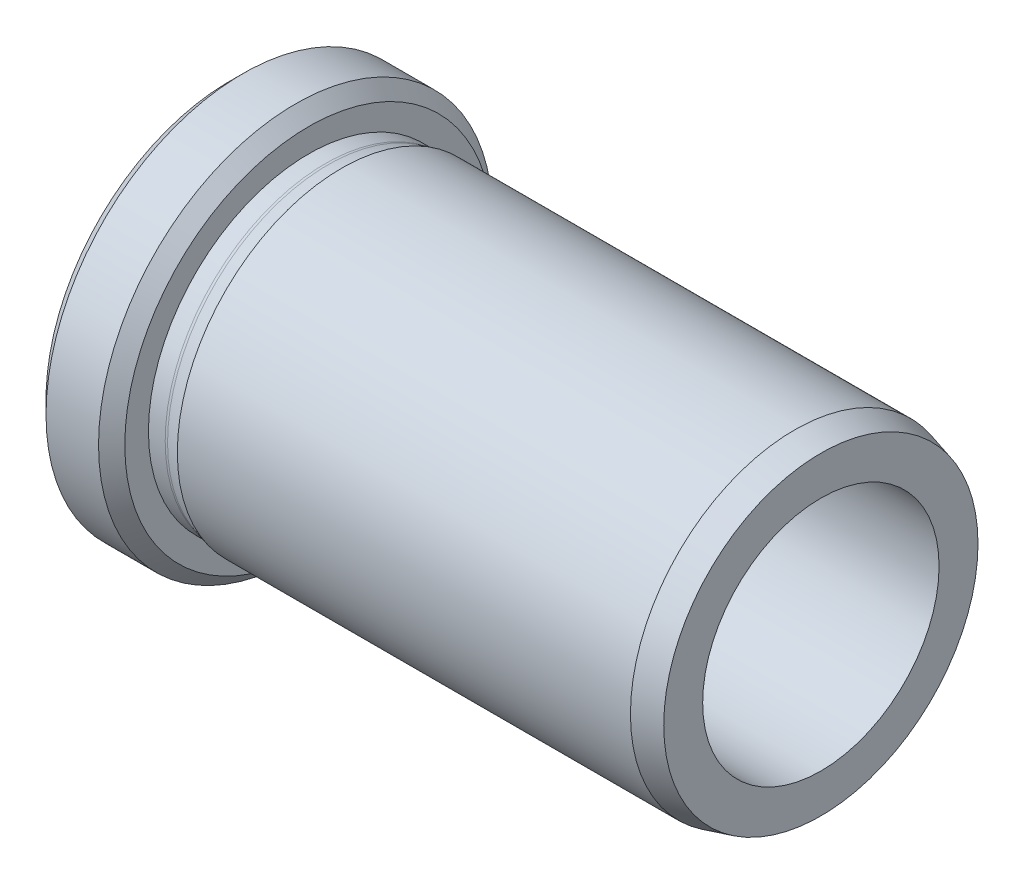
ISO-10303-21;
HEADER;
FILE_DESCRIPTION(('STEP AP214'),'2;1');
FILE_NAME('part.step','',(''),(''),'','','');
FILE_SCHEMA(('AUTOMOTIVE_DESIGN { 1 0 10303 214 1 1 1 1 }'));
ENDSEC;
DATA;
#1=APPLICATION_CONTEXT('core data for automotive mechanical design processes');
#2=APPLICATION_PROTOCOL_DEFINITION('international standard','automotive_design',2000,#1);
#3=PRODUCT_CONTEXT('',#1,'mechanical');
#4=PRODUCT('Part','Part','',(#3));
#5=PRODUCT_RELATED_PRODUCT_CATEGORY('part','',(#4));
#6=PRODUCT_DEFINITION_FORMATION('','',#4);
#7=PRODUCT_DEFINITION_CONTEXT('part definition',#1,'design');
#8=PRODUCT_DEFINITION('design','',#6,#7);
#9=PRODUCT_DEFINITION_SHAPE('','',#8);
#10=(LENGTH_UNIT() NAMED_UNIT(*) SI_UNIT(.MILLI.,.METRE.));
#11=(NAMED_UNIT(*) PLANE_ANGLE_UNIT() SI_UNIT($,.RADIAN.));
#12=(NAMED_UNIT(*) SI_UNIT($,.STERADIAN.) SOLID_ANGLE_UNIT());
#13=UNCERTAINTY_MEASURE_WITH_UNIT(LENGTH_MEASURE(1.E-05),#10,'distance_accuracy_value','');
#14=(GEOMETRIC_REPRESENTATION_CONTEXT(3) GLOBAL_UNCERTAINTY_ASSIGNED_CONTEXT((#13)) GLOBAL_UNIT_ASSIGNED_CONTEXT((#10,
#11,#12)) REPRESENTATION_CONTEXT('',''));
#15=CARTESIAN_POINT('',(0.,0.,0.));
#16=DIRECTION('',(0.,0.,1.));
#17=DIRECTION('',(1.,0.,0.));
#18=AXIS2_PLACEMENT_3D('',#15,#16,#17);
#19=CARTESIAN_POINT('',(18.075539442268,0.,0.));
#20=DIRECTION('',(-1.,0.,0.));
#21=DIRECTION('',(0.,0.,1.));
#22=AXIS2_PLACEMENT_3D('',#19,#20,#21);
#23=TOROIDAL_SURFACE('',#22,13.,0.8);
#24=CARTESIAN_POINT('',(18.075539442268,0.,0.));
#25=DIRECTION('',(-1.,0.,0.));
#26=DIRECTION('',(0.,0.,1.));
#27=AXIS2_PLACEMENT_3D('',#24,#25,#26);
#28=CIRCLE('',#27,12.2);
#29=CARTESIAN_POINT('',(18.075539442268,0.,12.2));
#30=VERTEX_POINT('',#29);
#31=EDGE_CURVE('E72',#30,#30,#28,.T.);
#32=ORIENTED_EDGE('',*,*,#31,.F.);
#33=EDGE_LOOP('',(#32));
#34=FACE_BOUND('',#33,.T.);
#35=CARTESIAN_POINT('',(18.28259467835,0.,0.));
#36=DIRECTION('',(-1.,0.,0.));
#37=DIRECTION('',(0.,0.,1.));
#38=AXIS2_PLACEMENT_3D('',#35,#36,#37);
#39=CIRCLE('',#38,12.2272593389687);
#40=CARTESIAN_POINT('',(18.28259467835,0.,12.2272593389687));
#41=VERTEX_POINT('',#40);
#42=EDGE_CURVE('E50',#41,#41,#39,.T.);
#43=ORIENTED_EDGE('',*,*,#42,.T.);
#44=EDGE_LOOP('',(#43));
#45=FACE_BOUND('',#44,.T.);
#46=ADVANCED_FACE('F14',(#34,#45),#23,.F.);
#47=CARTESIAN_POINT('',(19.3004766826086,0.,0.));
#48=DIRECTION('',(1.,0.,0.));
#49=DIRECTION('',(0.,0.,-1.));
#50=AXIS2_PLACEMENT_3D('',#47,#48,#49);
#51=CONICAL_SURFACE('',#50,12.5,0.261799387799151);
#52=ORIENTED_EDGE('',*,*,#42,.F.);
#53=EDGE_LOOP('',(#52));
#54=FACE_BOUND('',#53,.T.);
#55=CARTESIAN_POINT('',(19.3004766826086,0.,0.));
#56=DIRECTION('',(-1.,0.,0.));
#57=DIRECTION('',(0.,0.,1.));
#58=AXIS2_PLACEMENT_3D('',#55,#56,#57);
#59=CIRCLE('',#58,12.5);
#60=CARTESIAN_POINT('',(19.3004766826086,0.,12.5));
#61=VERTEX_POINT('',#60);
#62=EDGE_CURVE('E54',#61,#61,#59,.T.);
#63=ORIENTED_EDGE('',*,*,#62,.T.);
#64=EDGE_LOOP('',(#63));
#65=FACE_BOUND('',#64,.T.);
#66=ADVANCED_FACE('F80',(#54,#65),#51,.T.);
#67=CARTESIAN_POINT('',(0.,0.,0.));
#68=DIRECTION('',(-1.,0.,0.));
#69=DIRECTION('',(0.,0.,1.));
#70=AXIS2_PLACEMENT_3D('',#67,#68,#69);
#71=CYLINDRICAL_SURFACE('',#70,12.5);
#72=ORIENTED_EDGE('',*,*,#62,.F.);
#73=EDGE_LOOP('',(#72));
#74=FACE_BOUND('',#73,.T.);
#75=CARTESIAN_POINT('',(53.8004766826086,0.,0.));
#76=DIRECTION('',(-1.,0.,0.));
#77=DIRECTION('',(0.,0.,1.));
#78=AXIS2_PLACEMENT_3D('',#75,#76,#77);
#79=CIRCLE('',#78,12.5);
#80=CARTESIAN_POINT('',(53.8004766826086,0.,12.5));
#81=VERTEX_POINT('',#80);
#82=EDGE_CURVE('E58',#81,#81,#79,.T.);
#83=ORIENTED_EDGE('',*,*,#82,.T.);
#84=EDGE_LOOP('',(#83));
#85=FACE_BOUND('',#84,.T.);
#86=ADVANCED_FACE('F86',(#74,#85),#71,.T.);
#87=CARTESIAN_POINT('',(55.8004766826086,0.,0.));
#88=DIRECTION('',(-1.,0.,0.));
#89=DIRECTION('',(0.,0.,1.));
#90=AXIS2_PLACEMENT_3D('',#87,#88,#89);
#91=CONICAL_SURFACE('',#90,11.9641016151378,0.26179938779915);
#92=ORIENTED_EDGE('',*,*,#82,.F.);
#93=EDGE_LOOP('',(#92));
#94=FACE_BOUND('',#93,.T.);
#95=CARTESIAN_POINT('',(55.8004766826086,0.,0.));
#96=DIRECTION('',(-1.,0.,0.));
#97=DIRECTION('',(0.,0.,1.));
#98=AXIS2_PLACEMENT_3D('',#95,#96,#97);
#99=CIRCLE('',#98,11.9641016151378);
#100=CARTESIAN_POINT('',(55.8004766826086,0.,11.9641016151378));
#101=VERTEX_POINT('',#100);
#102=EDGE_CURVE('E61',#101,#101,#99,.T.);
#103=ORIENTED_EDGE('',*,*,#102,.T.);
#104=EDGE_LOOP('',(#103));
#105=FACE_BOUND('',#104,.T.);
#106=ADVANCED_FACE('F92',(#94,#105),#91,.T.);
#107=CARTESIAN_POINT('',(55.8004766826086,11.9641016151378,0.));
#108=DIRECTION('',(-1.,0.,0.));
#109=DIRECTION('',(0.,0.,1.));
#110=AXIS2_PLACEMENT_3D('',#107,#108,#109);
#111=PLANE('',#110);
#112=ORIENTED_EDGE('',*,*,#102,.F.);
#113=EDGE_LOOP('',(#112));
#114=FACE_BOUND('',#113,.T.);
#115=CARTESIAN_POINT('',(55.8004766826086,0.,0.));
#116=DIRECTION('',(-1.,0.,0.));
#117=DIRECTION('',(0.,0.,1.));
#118=AXIS2_PLACEMENT_3D('',#115,#116,#117);
#119=CIRCLE('',#118,9.);
#120=CARTESIAN_POINT('',(55.8004766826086,0.,9.));
#121=VERTEX_POINT('',#120);
#122=EDGE_CURVE('E65',#121,#121,#119,.T.);
#123=ORIENTED_EDGE('',*,*,#122,.T.);
#124=EDGE_LOOP('',(#123));
#125=FACE_BOUND('',#124,.T.);
#126=ADVANCED_FACE('F98',(#114,#125),#111,.F.);
#127=CARTESIAN_POINT('',(0.,0.,0.));
#128=DIRECTION('',(-1.,0.,0.));
#129=DIRECTION('',(0.,0.,1.));
#130=AXIS2_PLACEMENT_3D('',#127,#128,#129);
#131=CYLINDRICAL_SURFACE('',#130,9.);
#132=CARTESIAN_POINT('',(12.3004766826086,0.,0.));
#133=DIRECTION('',(1.,0.,0.));
#134=DIRECTION('',(0.,0.,-1.));
#135=AXIS2_PLACEMENT_3D('',#132,#133,#134);
#136=CIRCLE('',#135,9.);
#137=CARTESIAN_POINT('',(12.3004766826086,0.,-9.));
#138=VERTEX_POINT('',#137);
#139=EDGE_CURVE('E37',#138,#138,#136,.F.);
#140=ORIENTED_EDGE('',*,*,#139,.T.);
#141=EDGE_LOOP('',(#140));
#142=FACE_BOUND('',#141,.T.);
#143=ORIENTED_EDGE('',*,*,#122,.F.);
#144=EDGE_LOOP('',(#143));
#145=FACE_BOUND('',#144,.T.);
#146=ADVANCED_FACE('F104',(#142,#145),#131,.F.);
#147=CARTESIAN_POINT('',(10.8004766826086,15.,0.));
#148=DIRECTION('',(1.,0.,0.));
#149=DIRECTION('',(0.,0.,-1.));
#150=AXIS2_PLACEMENT_3D('',#147,#148,#149);
#151=PLANE('',#150);
#152=CARTESIAN_POINT('',(10.8004766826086,0.,0.));
#153=DIRECTION('',(1.,0.,0.));
#154=DIRECTION('',(0.,0.,-1.));
#155=AXIS2_PLACEMENT_3D('',#152,#153,#154);
#156=CIRCLE('',#155,10.5);
#157=CARTESIAN_POINT('',(10.8004766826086,0.,-10.5));
#158=VERTEX_POINT('',#157);
#159=EDGE_CURVE('E30',#158,#158,#156,.T.);
#160=ORIENTED_EDGE('',*,*,#159,.T.);
#161=EDGE_LOOP('',(#160));
#162=FACE_BOUND('',#161,.T.);
#163=CARTESIAN_POINT('',(10.8004766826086,0.,0.));
#164=DIRECTION('',(1.,0.,0.));
#165=DIRECTION('',(0.,0.,-1.));
#166=AXIS2_PLACEMENT_3D('',#163,#164,#165);
#167=CIRCLE('',#166,14.);
#168=CARTESIAN_POINT('',(10.8004766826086,0.,-14.));
#169=VERTEX_POINT('',#168);
#170=EDGE_CURVE('E47',#169,#169,#167,.F.);
#171=ORIENTED_EDGE('',*,*,#170,.T.);
#172=EDGE_LOOP('',(#171));
#173=FACE_BOUND('',#172,.T.);
#174=ADVANCED_FACE('F109',(#162,#173),#151,.F.);
#175=CARTESIAN_POINT('',(0.,0.,0.));
#176=DIRECTION('',(-1.,0.,0.));
#177=DIRECTION('',(0.,0.,1.));
#178=AXIS2_PLACEMENT_3D('',#175,#176,#177);
#179=CYLINDRICAL_SURFACE('',#178,15.);
#180=CARTESIAN_POINT('',(15.8004766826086,0.,0.));
#181=DIRECTION('',(-1.,0.,0.));
#182=DIRECTION('',(0.,0.,1.));
#183=AXIS2_PLACEMENT_3D('',#180,#181,#182);
#184=CIRCLE('',#183,15.);
#185=CARTESIAN_POINT('',(15.8004766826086,0.,15.));
#186=VERTEX_POINT('',#185);
#187=EDGE_CURVE('E22',#186,#186,#184,.T.);
#188=ORIENTED_EDGE('',*,*,#187,.T.);
#189=EDGE_LOOP('',(#188));
#190=FACE_BOUND('',#189,.T.);
#191=CARTESIAN_POINT('',(11.8004766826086,0.,0.));
#192=DIRECTION('',(1.,0.,0.));
#193=DIRECTION('',(0.,0.,-1.));
#194=AXIS2_PLACEMENT_3D('',#191,#192,#193);
#195=CIRCLE('',#194,15.);
#196=CARTESIAN_POINT('',(11.8004766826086,0.,-15.));
#197=VERTEX_POINT('',#196);
#198=EDGE_CURVE('E43',#197,#197,#195,.T.);
#199=ORIENTED_EDGE('',*,*,#198,.T.);
#200=EDGE_LOOP('',(#199));
#201=FACE_BOUND('',#200,.T.);
#202=ADVANCED_FACE('F116',(#190,#201),#179,.T.);
#203=CARTESIAN_POINT('',(16.8004766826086,15.,0.));
#204=DIRECTION('',(-1.,0.,0.));
#205=DIRECTION('',(0.,0.,1.));
#206=AXIS2_PLACEMENT_3D('',#203,#204,#205);
#207=PLANE('',#206);
#208=CARTESIAN_POINT('',(16.8004766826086,0.,0.));
#209=DIRECTION('',(-1.,0.,0.));
#210=DIRECTION('',(0.,0.,1.));
#211=AXIS2_PLACEMENT_3D('',#208,#209,#210);
#212=CIRCLE('',#211,14.);
#213=CARTESIAN_POINT('',(16.8004766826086,0.,14.));
#214=VERTEX_POINT('',#213);
#215=EDGE_CURVE('E9',#214,#214,#212,.F.);
#216=ORIENTED_EDGE('',*,*,#215,.T.);
#217=EDGE_LOOP('',(#216));
#218=FACE_BOUND('',#217,.T.);
#219=CARTESIAN_POINT('',(16.8004766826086,0.,0.));
#220=DIRECTION('',(-1.,0.,0.));
#221=DIRECTION('',(0.,0.,1.));
#222=AXIS2_PLACEMENT_3D('',#219,#220,#221);
#223=CIRCLE('',#222,12.2);
#224=CARTESIAN_POINT('',(16.8004766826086,0.,12.2));
#225=VERTEX_POINT('',#224);
#226=EDGE_CURVE('E69',#225,#225,#223,.T.);
#227=ORIENTED_EDGE('',*,*,#226,.T.);
#228=EDGE_LOOP('',(#227));
#229=FACE_BOUND('',#228,.T.);
#230=ADVANCED_FACE('F163',(#218,#229),#207,.F.);
#231=CARTESIAN_POINT('',(0.,0.,0.));
#232=DIRECTION('',(-1.,0.,0.));
#233=DIRECTION('',(0.,0.,1.));
#234=AXIS2_PLACEMENT_3D('',#231,#232,#233);
#235=CYLINDRICAL_SURFACE('',#234,12.2);
#236=ORIENTED_EDGE('',*,*,#226,.F.);
#237=EDGE_LOOP('',(#236));
#238=FACE_BOUND('',#237,.T.);
#239=ORIENTED_EDGE('',*,*,#31,.T.);
#240=EDGE_LOOP('',(#239));
#241=FACE_BOUND('',#240,.T.);
#242=ADVANCED_FACE('F76',(#238,#241),#235,.T.);
#243=CARTESIAN_POINT('',(10.8004766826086,0.,0.));
#244=DIRECTION('',(1.,0.,0.));
#245=DIRECTION('',(0.,0.,-1.));
#246=AXIS2_PLACEMENT_3D('',#243,#244,#245);
#247=CONICAL_SURFACE('',#246,14.,0.785398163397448);
#248=ORIENTED_EDGE('',*,*,#198,.F.);
#249=EDGE_LOOP('',(#248));
#250=FACE_BOUND('',#249,.T.);
#251=ORIENTED_EDGE('',*,*,#170,.F.);
#252=EDGE_LOOP('',(#251));
#253=FACE_BOUND('',#252,.T.);
#254=ADVANCED_FACE('F121',(#250,#253),#247,.T.);
#255=CARTESIAN_POINT('',(12.3004766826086,0.,0.));
#256=DIRECTION('',(1.,0.,0.));
#257=DIRECTION('',(0.,0.,-1.));
#258=AXIS2_PLACEMENT_3D('',#255,#256,#257);
#259=TOROIDAL_SURFACE('',#258,10.5,1.5);
#260=ORIENTED_EDGE('',*,*,#159,.F.);
#261=EDGE_LOOP('',(#260));
#262=FACE_BOUND('',#261,.T.);
#263=ORIENTED_EDGE('',*,*,#139,.F.);
#264=EDGE_LOOP('',(#263));
#265=FACE_BOUND('',#264,.T.);
#266=ADVANCED_FACE('F123',(#262,#265),#259,.T.);
#267=CARTESIAN_POINT('',(15.8004766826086,0.,0.));
#268=DIRECTION('',(-1.,0.,0.));
#269=DIRECTION('',(0.,0.,1.));
#270=AXIS2_PLACEMENT_3D('',#267,#268,#269);
#271=CONICAL_SURFACE('',#270,15.,0.785398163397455);
#272=ORIENTED_EDGE('',*,*,#215,.F.);
#273=EDGE_LOOP('',(#272));
#274=FACE_BOUND('',#273,.T.);
#275=ORIENTED_EDGE('',*,*,#187,.F.);
#276=EDGE_LOOP('',(#275));
#277=FACE_BOUND('',#276,.T.);
#278=ADVANCED_FACE('F16',(#274,#277),#271,.T.);
#279=CLOSED_SHELL('',(#46,#66,#86,#106,#126,#146,#174,#202,#230,#242,#254,#266,#278));
#280=MANIFOLD_SOLID_BREP('B1',#279);
#281=ADVANCED_BREP_SHAPE_REPRESENTATION('',(#18,#280),#14);
#282=SHAPE_DEFINITION_REPRESENTATION(#9,#281);
ENDSEC;
END-ISO-10303-21;
